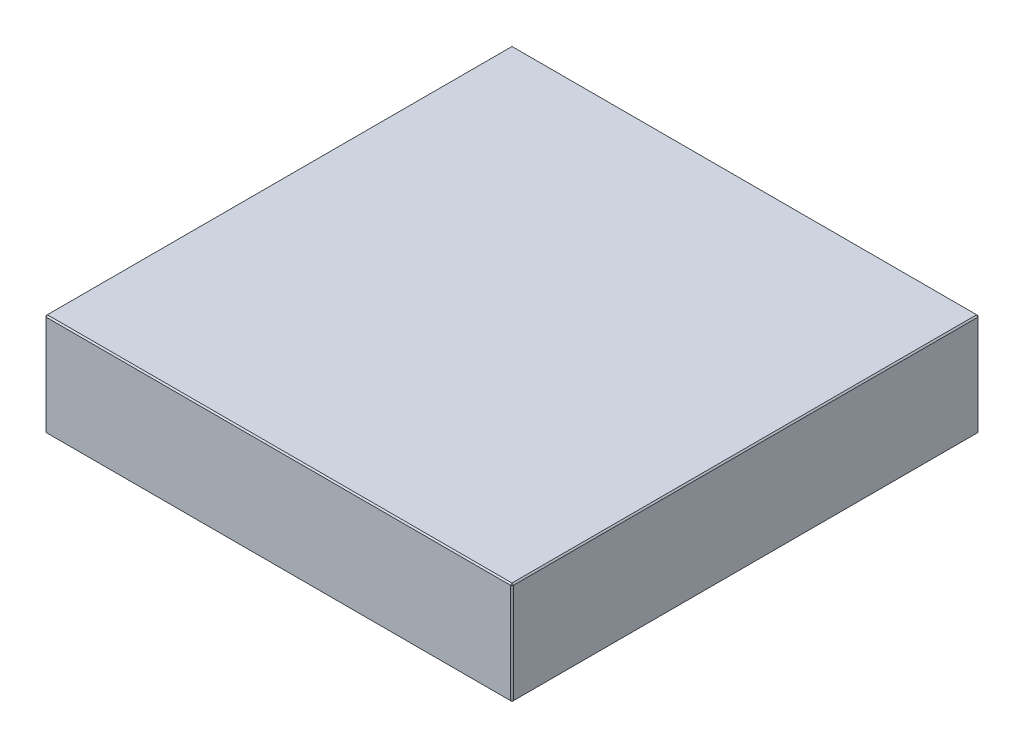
ISO-10303-21;
HEADER;
FILE_DESCRIPTION(('STEP AP214'),'2;1');
FILE_NAME('part.step','',(''),(''),'','','');
FILE_SCHEMA(('AUTOMOTIVE_DESIGN { 1 0 10303 214 1 1 1 1 }'));
ENDSEC;
DATA;
#1=APPLICATION_CONTEXT('core data for automotive mechanical design processes');
#2=APPLICATION_PROTOCOL_DEFINITION('international standard','automotive_design',2000,#1);
#3=PRODUCT_CONTEXT('',#1,'mechanical');
#4=PRODUCT('Part','Part','',(#3));
#5=PRODUCT_RELATED_PRODUCT_CATEGORY('part','',(#4));
#6=PRODUCT_DEFINITION_FORMATION('','',#4);
#7=PRODUCT_DEFINITION_CONTEXT('part definition',#1,'design');
#8=PRODUCT_DEFINITION('design','',#6,#7);
#9=PRODUCT_DEFINITION_SHAPE('','',#8);
#10=(LENGTH_UNIT() NAMED_UNIT(*) SI_UNIT(.MILLI.,.METRE.));
#11=(NAMED_UNIT(*) PLANE_ANGLE_UNIT() SI_UNIT($,.RADIAN.));
#12=(NAMED_UNIT(*) SI_UNIT($,.STERADIAN.) SOLID_ANGLE_UNIT());
#13=UNCERTAINTY_MEASURE_WITH_UNIT(LENGTH_MEASURE(1.E-05),#10,'distance_accuracy_value','');
#14=(GEOMETRIC_REPRESENTATION_CONTEXT(3) GLOBAL_UNCERTAINTY_ASSIGNED_CONTEXT((#13)) GLOBAL_UNIT_ASSIGNED_CONTEXT((#10,
#11,#12)) REPRESENTATION_CONTEXT('',''));
#15=CARTESIAN_POINT('',(0.,0.,0.));
#16=DIRECTION('',(0.,0.,1.));
#17=DIRECTION('',(1.,0.,0.));
#18=AXIS2_PLACEMENT_3D('',#15,#16,#17);
#19=CARTESIAN_POINT('',(-173.,76.,173.));
#20=DIRECTION('',(1.,0.,0.));
#21=DIRECTION('',(0.,0.,-1.));
#22=AXIS2_PLACEMENT_3D('',#19,#20,#21);
#23=PLANE('',#22);
#24=DIRECTION('',(0.,-1.,0.));
#25=VECTOR('',#24,1.);
#26=CARTESIAN_POINT('',(-173.,76.,-172.));
#27=LINE('',#26,#25);
#28=CARTESIAN_POINT('',(-173.,75.,-172.));
#29=VERTEX_POINT('',#28);
#30=CARTESIAN_POINT('',(-173.,1.,-172.));
#31=VERTEX_POINT('',#30);
#32=EDGE_CURVE('E114',#29,#31,#27,.T.);
#33=ORIENTED_EDGE('',*,*,#32,.T.);
#34=DIRECTION('',(0.,0.,1.));
#35=VECTOR('',#34,1.);
#36=CARTESIAN_POINT('',(-173.,1.,173.));
#37=LINE('',#36,#35);
#38=CARTESIAN_POINT('',(-173.,1.,172.));
#39=VERTEX_POINT('',#38);
#40=EDGE_CURVE('E110',#31,#39,#37,.T.);
#41=ORIENTED_EDGE('',*,*,#40,.T.);
#42=DIRECTION('',(0.,1.,0.));
#43=VECTOR('',#42,1.);
#44=CARTESIAN_POINT('',(-173.,76.,172.));
#45=LINE('',#44,#43);
#46=CARTESIAN_POINT('',(-173.,75.,172.));
#47=VERTEX_POINT('',#46);
#48=EDGE_CURVE('E103',#39,#47,#45,.T.);
#49=ORIENTED_EDGE('',*,*,#48,.T.);
#50=DIRECTION('',(0.,0.,-1.));
#51=VECTOR('',#50,1.);
#52=CARTESIAN_POINT('',(-173.,75.,-173.));
#53=LINE('',#52,#51);
#54=EDGE_CURVE('E107',#47,#29,#53,.T.);
#55=ORIENTED_EDGE('',*,*,#54,.T.);
#56=EDGE_LOOP('',(#33,#41,#49,#55));
#57=FACE_BOUND('',#56,.T.);
#58=ADVANCED_FACE('F15',(#57),#23,.F.);
#59=CARTESIAN_POINT('',(173.,76.,173.));
#60=DIRECTION('',(0.,0.,-1.));
#61=DIRECTION('',(-1.,0.,0.));
#62=AXIS2_PLACEMENT_3D('',#59,#60,#61);
#63=PLANE('',#62);
#64=DIRECTION('',(-1.,0.,0.));
#65=VECTOR('',#64,1.);
#66=CARTESIAN_POINT('',(-173.,75.,173.));
#67=LINE('',#66,#65);
#68=CARTESIAN_POINT('',(172.,75.,173.));
#69=VERTEX_POINT('',#68);
#70=CARTESIAN_POINT('',(-172.,75.,173.));
#71=VERTEX_POINT('',#70);
#72=EDGE_CURVE('E164',#69,#71,#67,.T.);
#73=ORIENTED_EDGE('',*,*,#72,.T.);
#74=DIRECTION('',(0.,-1.,0.));
#75=VECTOR('',#74,1.);
#76=CARTESIAN_POINT('',(-172.,76.,173.));
#77=LINE('',#76,#75);
#78=CARTESIAN_POINT('',(-172.,1.,173.));
#79=VERTEX_POINT('',#78);
#80=EDGE_CURVE('E122',#71,#79,#77,.T.);
#81=ORIENTED_EDGE('',*,*,#80,.T.);
#82=DIRECTION('',(1.,0.,0.));
#83=VECTOR('',#82,1.);
#84=CARTESIAN_POINT('',(173.,1.,173.));
#85=LINE('',#84,#83);
#86=CARTESIAN_POINT('',(172.,1.,173.));
#87=VERTEX_POINT('',#86);
#88=EDGE_CURVE('E168',#79,#87,#85,.T.);
#89=ORIENTED_EDGE('',*,*,#88,.T.);
#90=DIRECTION('',(0.,1.,0.));
#91=VECTOR('',#90,1.);
#92=CARTESIAN_POINT('',(172.,76.,173.));
#93=LINE('',#92,#91);
#94=EDGE_CURVE('E166',#87,#69,#93,.T.);
#95=ORIENTED_EDGE('',*,*,#94,.T.);
#96=EDGE_LOOP('',(#73,#81,#89,#95));
#97=FACE_BOUND('',#96,.T.);
#98=ADVANCED_FACE('F275',(#97),#63,.F.);
#99=CARTESIAN_POINT('',(173.,76.,173.));
#100=DIRECTION('',(-1.,0.,0.));
#101=DIRECTION('',(0.,0.,1.));
#102=AXIS2_PLACEMENT_3D('',#99,#100,#101);
#103=PLANE('',#102);
#104=DIRECTION('',(0.,0.,-1.));
#105=VECTOR('',#104,1.);
#106=CARTESIAN_POINT('',(173.,1.,173.));
#107=LINE('',#106,#105);
#108=CARTESIAN_POINT('',(173.,1.,172.));
#109=VERTEX_POINT('',#108);
#110=CARTESIAN_POINT('',(173.,1.,-172.));
#111=VERTEX_POINT('',#110);
#112=EDGE_CURVE('E159',#109,#111,#107,.T.);
#113=ORIENTED_EDGE('',*,*,#112,.T.);
#114=DIRECTION('',(0.,1.,0.));
#115=VECTOR('',#114,1.);
#116=CARTESIAN_POINT('',(173.,76.,-172.));
#117=LINE('',#116,#115);
#118=CARTESIAN_POINT('',(173.,75.,-172.));
#119=VERTEX_POINT('',#118);
#120=EDGE_CURVE('E161',#111,#119,#117,.T.);
#121=ORIENTED_EDGE('',*,*,#120,.T.);
#122=DIRECTION('',(0.,0.,1.));
#123=VECTOR('',#122,1.);
#124=CARTESIAN_POINT('',(173.,75.,173.));
#125=LINE('',#124,#123);
#126=CARTESIAN_POINT('',(173.,75.,172.));
#127=VERTEX_POINT('',#126);
#128=EDGE_CURVE('E155',#119,#127,#125,.T.);
#129=ORIENTED_EDGE('',*,*,#128,.T.);
#130=DIRECTION('',(0.,-1.,0.));
#131=VECTOR('',#130,1.);
#132=CARTESIAN_POINT('',(173.,76.,172.));
#133=LINE('',#132,#131);
#134=EDGE_CURVE('E157',#127,#109,#133,.T.);
#135=ORIENTED_EDGE('',*,*,#134,.T.);
#136=EDGE_LOOP('',(#113,#121,#129,#135));
#137=FACE_BOUND('',#136,.T.);
#138=ADVANCED_FACE('F254',(#137),#103,.F.);
#139=CARTESIAN_POINT('',(173.,76.,-173.));
#140=DIRECTION('',(0.,0.,1.));
#141=DIRECTION('',(1.,0.,0.));
#142=AXIS2_PLACEMENT_3D('',#139,#140,#141);
#143=PLANE('',#142);
#144=DIRECTION('',(0.,-1.,0.));
#145=VECTOR('',#144,1.);
#146=CARTESIAN_POINT('',(172.,76.,-173.));
#147=LINE('',#146,#145);
#148=CARTESIAN_POINT('',(172.,75.,-173.));
#149=VERTEX_POINT('',#148);
#150=CARTESIAN_POINT('',(172.,1.,-173.));
#151=VERTEX_POINT('',#150);
#152=EDGE_CURVE('E148',#149,#151,#147,.T.);
#153=ORIENTED_EDGE('',*,*,#152,.T.);
#154=DIRECTION('',(-1.,0.,0.));
#155=VECTOR('',#154,1.);
#156=CARTESIAN_POINT('',(173.,1.,-173.));
#157=LINE('',#156,#155);
#158=CARTESIAN_POINT('',(-172.,1.,-173.));
#159=VERTEX_POINT('',#158);
#160=EDGE_CURVE('E153',#151,#159,#157,.T.);
#161=ORIENTED_EDGE('',*,*,#160,.T.);
#162=DIRECTION('',(0.,1.,0.));
#163=VECTOR('',#162,1.);
#164=CARTESIAN_POINT('',(-172.,76.,-173.));
#165=LINE('',#164,#163);
#166=CARTESIAN_POINT('',(-172.,75.,-173.));
#167=VERTEX_POINT('',#166);
#168=EDGE_CURVE('E150',#159,#167,#165,.T.);
#169=ORIENTED_EDGE('',*,*,#168,.T.);
#170=DIRECTION('',(1.,0.,0.));
#171=VECTOR('',#170,1.);
#172=CARTESIAN_POINT('',(173.,75.,-173.));
#173=LINE('',#172,#171);
#174=EDGE_CURVE('E146',#167,#149,#173,.T.);
#175=ORIENTED_EDGE('',*,*,#174,.T.);
#176=EDGE_LOOP('',(#153,#161,#169,#175));
#177=FACE_BOUND('',#176,.T.);
#178=ADVANCED_FACE('F284',(#177),#143,.F.);
#179=CARTESIAN_POINT('',(0.,76.,0.));
#180=DIRECTION('',(0.,1.,0.));
#181=DIRECTION('',(0.,0.,1.));
#182=AXIS2_PLACEMENT_3D('',#179,#180,#181);
#183=PLANE('',#182);
#184=DIRECTION('',(0.,0.,-1.));
#185=VECTOR('',#184,1.);
#186=CARTESIAN_POINT('',(172.,76.,-173.));
#187=LINE('',#186,#185);
#188=CARTESIAN_POINT('',(172.,76.,172.));
#189=VERTEX_POINT('',#188);
#190=CARTESIAN_POINT('',(172.,76.,-172.));
#191=VERTEX_POINT('',#190);
#192=EDGE_CURVE('E24',#189,#191,#187,.T.);
#193=ORIENTED_EDGE('',*,*,#192,.T.);
#194=DIRECTION('',(-1.,0.,0.));
#195=VECTOR('',#194,1.);
#196=CARTESIAN_POINT('',(-173.,76.,-172.));
#197=LINE('',#196,#195);
#198=CARTESIAN_POINT('',(-172.,76.,-172.));
#199=VERTEX_POINT('',#198);
#200=EDGE_CURVE('E9',#191,#199,#197,.T.);
#201=ORIENTED_EDGE('',*,*,#200,.T.);
#202=DIRECTION('',(0.,0.,1.));
#203=VECTOR('',#202,1.);
#204=CARTESIAN_POINT('',(-172.,76.,173.));
#205=LINE('',#204,#203);
#206=CARTESIAN_POINT('',(-172.,76.,172.));
#207=VERTEX_POINT('',#206);
#208=EDGE_CURVE('E180',#199,#207,#205,.T.);
#209=ORIENTED_EDGE('',*,*,#208,.T.);
#210=DIRECTION('',(1.,0.,0.));
#211=VECTOR('',#210,1.);
#212=CARTESIAN_POINT('',(173.,76.,172.));
#213=LINE('',#212,#211);
#214=EDGE_CURVE('E35',#207,#189,#213,.T.);
#215=ORIENTED_EDGE('',*,*,#214,.T.);
#216=EDGE_LOOP('',(#193,#201,#209,#215));
#217=FACE_BOUND('',#216,.T.);
#218=ADVANCED_FACE('F350',(#217),#183,.T.);
#219=CARTESIAN_POINT('',(0.,0.,0.));
#220=DIRECTION('',(0.,1.,0.));
#221=DIRECTION('',(0.,0.,1.));
#222=AXIS2_PLACEMENT_3D('',#219,#220,#221);
#223=PLANE('',#222);
#224=DIRECTION('',(0.,0.,1.));
#225=VECTOR('',#224,1.);
#226=CARTESIAN_POINT('',(172.,0.,0.));
#227=LINE('',#226,#225);
#228=CARTESIAN_POINT('',(172.,0.,-172.));
#229=VERTEX_POINT('',#228);
#230=CARTESIAN_POINT('',(172.,0.,172.));
#231=VERTEX_POINT('',#230);
#232=EDGE_CURVE('E171',#229,#231,#227,.T.);
#233=ORIENTED_EDGE('',*,*,#232,.T.);
#234=DIRECTION('',(-1.,0.,0.));
#235=VECTOR('',#234,1.);
#236=CARTESIAN_POINT('',(0.,0.,172.));
#237=LINE('',#236,#235);
#238=CARTESIAN_POINT('',(-172.,0.,172.));
#239=VERTEX_POINT('',#238);
#240=EDGE_CURVE('E177',#231,#239,#237,.T.);
#241=ORIENTED_EDGE('',*,*,#240,.T.);
#242=DIRECTION('',(0.,0.,-1.));
#243=VECTOR('',#242,1.);
#244=CARTESIAN_POINT('',(-172.,0.,0.));
#245=LINE('',#244,#243);
#246=CARTESIAN_POINT('',(-172.,0.,-172.));
#247=VERTEX_POINT('',#246);
#248=EDGE_CURVE('E175',#239,#247,#245,.T.);
#249=ORIENTED_EDGE('',*,*,#248,.T.);
#250=DIRECTION('',(1.,0.,0.));
#251=VECTOR('',#250,1.);
#252=CARTESIAN_POINT('',(0.,0.,-172.));
#253=LINE('',#252,#251);
#254=EDGE_CURVE('E173',#247,#229,#253,.T.);
#255=ORIENTED_EDGE('',*,*,#254,.T.);
#256=EDGE_LOOP('',(#233,#241,#249,#255));
#257=FACE_BOUND('',#256,.T.);
#258=ADVANCED_FACE('F246',(#257),#223,.F.);
#259=CARTESIAN_POINT('',(173.,76.,172.));
#260=DIRECTION('',(-0.707106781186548,0.,-0.707106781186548));
#261=DIRECTION('',(0.,-1.,0.));
#262=AXIS2_PLACEMENT_3D('',#259,#260,#261);
#263=PLANE('',#262);
#264=DIRECTION('',(-0.707106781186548,0.,0.707106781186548));
#265=VECTOR('',#264,1.);
#266=CARTESIAN_POINT('',(172.,75.,173.));
#267=LINE('',#266,#265);
#268=EDGE_CURVE('E19',#69,#127,#267,.F.);
#269=ORIENTED_EDGE('',*,*,#268,.F.);
#270=ORIENTED_EDGE('',*,*,#94,.F.);
#271=DIRECTION('',(0.707106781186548,0.,-0.707106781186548));
#272=VECTOR('',#271,1.);
#273=CARTESIAN_POINT('',(172.,1.,173.));
#274=LINE('',#273,#272);
#275=EDGE_CURVE('E142',#109,#87,#274,.F.);
#276=ORIENTED_EDGE('',*,*,#275,.F.);
#277=ORIENTED_EDGE('',*,*,#134,.F.);
#278=EDGE_LOOP('',(#269,#270,#276,#277));
#279=FACE_BOUND('',#278,.T.);
#280=ADVANCED_FACE('F17',(#279),#263,.F.);
#281=CARTESIAN_POINT('',(172.,75.,173.));
#282=DIRECTION('',(0.577350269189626,0.577350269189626,0.577350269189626));
#283=DIRECTION('',(0.707106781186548,0.,-0.707106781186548));
#284=AXIS2_PLACEMENT_3D('',#281,#282,#283);
#285=PLANE('',#284);
#286=DIRECTION('',(0.,-0.707106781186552,0.707106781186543));
#287=VECTOR('',#286,1.);
#288=CARTESIAN_POINT('',(172.,75.,173.));
#289=LINE('',#288,#287);
#290=EDGE_CURVE('E226',#69,#189,#289,.F.);
#291=ORIENTED_EDGE('',*,*,#290,.F.);
#292=ORIENTED_EDGE('',*,*,#268,.T.);
#293=DIRECTION('',(-0.707106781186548,0.707106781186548,0.));
#294=VECTOR('',#293,1.);
#295=CARTESIAN_POINT('',(172.5,75.5,172.));
#296=LINE('',#295,#294);
#297=EDGE_CURVE('E228',#189,#127,#296,.F.);
#298=ORIENTED_EDGE('',*,*,#297,.F.);
#299=EDGE_LOOP('',(#291,#292,#298));
#300=FACE_BOUND('',#299,.T.);
#301=ADVANCED_FACE('F270',(#300),#285,.T.);
#302=CARTESIAN_POINT('',(172.,1.,173.));
#303=DIRECTION('',(0.577350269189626,-0.577350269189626,0.577350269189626));
#304=DIRECTION('',(0.707106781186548,0.,-0.707106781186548));
#305=AXIS2_PLACEMENT_3D('',#302,#303,#304);
#306=PLANE('',#305);
#307=DIRECTION('',(-0.707106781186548,-0.707106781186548,0.));
#308=VECTOR('',#307,1.);
#309=CARTESIAN_POINT('',(172.5,0.5,172.));
#310=LINE('',#309,#308);
#311=EDGE_CURVE('E220',#109,#231,#310,.T.);
#312=ORIENTED_EDGE('',*,*,#311,.F.);
#313=ORIENTED_EDGE('',*,*,#275,.T.);
#314=DIRECTION('',(0.,0.707106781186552,0.707106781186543));
#315=VECTOR('',#314,1.);
#316=CARTESIAN_POINT('',(172.,1.,173.));
#317=LINE('',#316,#315);
#318=EDGE_CURVE('E223',#231,#87,#317,.T.);
#319=ORIENTED_EDGE('',*,*,#318,.F.);
#320=EDGE_LOOP('',(#312,#313,#319));
#321=FACE_BOUND('',#320,.T.);
#322=ADVANCED_FACE('F235',(#321),#306,.T.);
#323=CARTESIAN_POINT('',(172.,76.,0.));
#324=DIRECTION('',(0.707106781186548,0.707106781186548,0.));
#325=DIRECTION('',(0.,0.,1.));
#326=AXIS2_PLACEMENT_3D('',#323,#324,#325);
#327=PLANE('',#326);
#328=ORIENTED_EDGE('',*,*,#297,.T.);
#329=ORIENTED_EDGE('',*,*,#128,.F.);
#330=DIRECTION('',(0.707106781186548,-0.707106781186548,0.));
#331=VECTOR('',#330,1.);
#332=CARTESIAN_POINT('',(173.,75.,-172.));
#333=LINE('',#332,#331);
#334=EDGE_CURVE('E215',#191,#119,#333,.T.);
#335=ORIENTED_EDGE('',*,*,#334,.F.);
#336=ORIENTED_EDGE('',*,*,#192,.F.);
#337=EDGE_LOOP('',(#328,#329,#335,#336));
#338=FACE_BOUND('',#337,.T.);
#339=ADVANCED_FACE('F265',(#338),#327,.T.);
#340=CARTESIAN_POINT('',(0.,76.,172.));
#341=DIRECTION('',(0.,0.707106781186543,0.707106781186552));
#342=DIRECTION('',(-1.,0.,0.));
#343=AXIS2_PLACEMENT_3D('',#340,#341,#342);
#344=PLANE('',#343);
#345=ORIENTED_EDGE('',*,*,#290,.T.);
#346=ORIENTED_EDGE('',*,*,#214,.F.);
#347=DIRECTION('',(0.,0.707106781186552,-0.707106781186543));
#348=VECTOR('',#347,1.);
#349=CARTESIAN_POINT('',(-172.,75.5,172.5));
#350=LINE('',#349,#348);
#351=EDGE_CURVE('E126',#71,#207,#350,.T.);
#352=ORIENTED_EDGE('',*,*,#351,.F.);
#353=ORIENTED_EDGE('',*,*,#72,.F.);
#354=EDGE_LOOP('',(#345,#346,#352,#353));
#355=FACE_BOUND('',#354,.T.);
#356=ADVANCED_FACE('F273',(#355),#344,.T.);
#357=CARTESIAN_POINT('',(-172.,76.,173.));
#358=DIRECTION('',(0.707106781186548,0.,-0.707106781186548));
#359=DIRECTION('',(0.,-1.,0.));
#360=AXIS2_PLACEMENT_3D('',#357,#358,#359);
#361=PLANE('',#360);
#362=DIRECTION('',(0.707106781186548,0.,0.707106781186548));
#363=VECTOR('',#362,1.);
#364=CARTESIAN_POINT('',(-172.,1.,173.));
#365=LINE('',#364,#363);
#366=EDGE_CURVE('E127',#79,#39,#365,.F.);
#367=ORIENTED_EDGE('',*,*,#366,.F.);
#368=ORIENTED_EDGE('',*,*,#80,.F.);
#369=DIRECTION('',(-0.707106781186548,0.,-0.707106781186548));
#370=VECTOR('',#369,1.);
#371=CARTESIAN_POINT('',(-173.,75.,172.));
#372=LINE('',#371,#370);
#373=EDGE_CURVE('E118',#47,#71,#372,.F.);
#374=ORIENTED_EDGE('',*,*,#373,.F.);
#375=ORIENTED_EDGE('',*,*,#48,.F.);
#376=EDGE_LOOP('',(#367,#368,#374,#375));
#377=FACE_BOUND('',#376,.T.);
#378=ADVANCED_FACE('F120',(#377),#361,.F.);
#379=CARTESIAN_POINT('',(173.,1.,173.));
#380=DIRECTION('',(0.,0.707106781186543,-0.707106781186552));
#381=DIRECTION('',(1.,0.,0.));
#382=AXIS2_PLACEMENT_3D('',#379,#380,#381);
#383=PLANE('',#382);
#384=ORIENTED_EDGE('',*,*,#318,.T.);
#385=ORIENTED_EDGE('',*,*,#88,.F.);
#386=DIRECTION('',(0.,-0.707106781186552,-0.707106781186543));
#387=VECTOR('',#386,1.);
#388=CARTESIAN_POINT('',(-172.,1.,173.));
#389=LINE('',#388,#387);
#390=EDGE_CURVE('E211',#239,#79,#389,.F.);
#391=ORIENTED_EDGE('',*,*,#390,.F.);
#392=ORIENTED_EDGE('',*,*,#240,.F.);
#393=EDGE_LOOP('',(#384,#385,#391,#392));
#394=FACE_BOUND('',#393,.T.);
#395=ADVANCED_FACE('F243',(#394),#383,.F.);
#396=CARTESIAN_POINT('',(173.,1.,173.));
#397=DIRECTION('',(-0.707106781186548,0.707106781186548,0.));
#398=DIRECTION('',(0.,0.,-1.));
#399=AXIS2_PLACEMENT_3D('',#396,#397,#398);
#400=PLANE('',#399);
#401=ORIENTED_EDGE('',*,*,#311,.T.);
#402=ORIENTED_EDGE('',*,*,#232,.F.);
#403=DIRECTION('',(0.707106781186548,0.707106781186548,0.));
#404=VECTOR('',#403,1.);
#405=CARTESIAN_POINT('',(172.5,0.499999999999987,-172.));
#406=LINE('',#405,#404);
#407=EDGE_CURVE('E208',#111,#229,#406,.F.);
#408=ORIENTED_EDGE('',*,*,#407,.F.);
#409=ORIENTED_EDGE('',*,*,#112,.F.);
#410=EDGE_LOOP('',(#401,#402,#408,#409));
#411=FACE_BOUND('',#410,.T.);
#412=ADVANCED_FACE('F251',(#411),#400,.F.);
#413=CARTESIAN_POINT('',(172.,76.,-173.));
#414=DIRECTION('',(-0.707106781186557,0.,0.707106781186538));
#415=DIRECTION('',(0.,-1.,0.));
#416=AXIS2_PLACEMENT_3D('',#413,#414,#415);
#417=PLANE('',#416);
#418=DIRECTION('',(0.707106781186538,0.,0.707106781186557));
#419=VECTOR('',#418,1.);
#420=CARTESIAN_POINT('',(173.,75.,-172.));
#421=LINE('',#420,#419);
#422=EDGE_CURVE('E217',#119,#149,#421,.F.);
#423=ORIENTED_EDGE('',*,*,#422,.F.);
#424=ORIENTED_EDGE('',*,*,#120,.F.);
#425=DIRECTION('',(-0.707106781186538,0.,-0.707106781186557));
#426=VECTOR('',#425,1.);
#427=CARTESIAN_POINT('',(172.,1.,-173.));
#428=LINE('',#427,#426);
#429=EDGE_CURVE('E205',#151,#111,#428,.F.);
#430=ORIENTED_EDGE('',*,*,#429,.F.);
#431=ORIENTED_EDGE('',*,*,#152,.F.);
#432=EDGE_LOOP('',(#423,#424,#430,#431));
#433=FACE_BOUND('',#432,.T.);
#434=ADVANCED_FACE('F258',(#433),#417,.F.);
#435=CARTESIAN_POINT('',(173.,75.,-172.));
#436=DIRECTION('',(0.577350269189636,0.57735026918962,-0.57735026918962));
#437=DIRECTION('',(-0.707106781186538,0.,-0.707106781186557));
#438=AXIS2_PLACEMENT_3D('',#435,#436,#437);
#439=PLANE('',#438);
#440=ORIENTED_EDGE('',*,*,#334,.T.);
#441=ORIENTED_EDGE('',*,*,#422,.T.);
#442=DIRECTION('',(0.,0.707106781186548,0.707106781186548));
#443=VECTOR('',#442,1.);
#444=CARTESIAN_POINT('',(172.,75.5,-172.5));
#445=LINE('',#444,#443);
#446=EDGE_CURVE('E134',#191,#149,#445,.F.);
#447=ORIENTED_EDGE('',*,*,#446,.F.);
#448=EDGE_LOOP('',(#440,#441,#447));
#449=FACE_BOUND('',#448,.T.);
#450=ADVANCED_FACE('F325',(#449),#439,.T.);
#451=CARTESIAN_POINT('',(-173.,75.,172.));
#452=DIRECTION('',(-0.577350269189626,0.577350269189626,0.577350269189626));
#453=DIRECTION('',(0.707106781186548,0.,0.707106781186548));
#454=AXIS2_PLACEMENT_3D('',#451,#452,#453);
#455=PLANE('',#454);
#456=ORIENTED_EDGE('',*,*,#373,.T.);
#457=ORIENTED_EDGE('',*,*,#351,.T.);
#458=DIRECTION('',(-0.707106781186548,-0.707106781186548,0.));
#459=VECTOR('',#458,1.);
#460=CARTESIAN_POINT('',(-173.,75.,172.));
#461=LINE('',#460,#459);
#462=EDGE_CURVE('E130',#47,#207,#461,.F.);
#463=ORIENTED_EDGE('',*,*,#462,.F.);
#464=EDGE_LOOP('',(#456,#457,#463));
#465=FACE_BOUND('',#464,.T.);
#466=ADVANCED_FACE('F131',(#465),#455,.T.);
#467=CARTESIAN_POINT('',(-172.,1.,173.));
#468=DIRECTION('',(-0.577350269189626,-0.577350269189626,0.577350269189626));
#469=DIRECTION('',(0.707106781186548,0.,0.707106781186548));
#470=AXIS2_PLACEMENT_3D('',#467,#468,#469);
#471=PLANE('',#470);
#472=ORIENTED_EDGE('',*,*,#390,.T.);
#473=ORIENTED_EDGE('',*,*,#366,.T.);
#474=DIRECTION('',(-0.707106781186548,0.707106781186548,0.));
#475=VECTOR('',#474,1.);
#476=CARTESIAN_POINT('',(-172.5,0.5,172.));
#477=LINE('',#476,#475);
#478=EDGE_CURVE('E135',#239,#39,#477,.T.);
#479=ORIENTED_EDGE('',*,*,#478,.F.);
#480=EDGE_LOOP('',(#472,#473,#479));
#481=FACE_BOUND('',#480,.T.);
#482=ADVANCED_FACE('F318',(#481),#471,.T.);
#483=CARTESIAN_POINT('',(172.,1.,-173.));
#484=DIRECTION('',(0.577350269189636,-0.57735026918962,-0.57735026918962));
#485=DIRECTION('',(-0.707106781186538,0.,-0.707106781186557));
#486=AXIS2_PLACEMENT_3D('',#483,#484,#485);
#487=PLANE('',#486);
#488=ORIENTED_EDGE('',*,*,#429,.T.);
#489=ORIENTED_EDGE('',*,*,#407,.T.);
#490=DIRECTION('',(0.,-0.707106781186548,0.707106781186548));
#491=VECTOR('',#490,1.);
#492=CARTESIAN_POINT('',(172.,1.,-173.));
#493=LINE('',#492,#491);
#494=EDGE_CURVE('E198',#151,#229,#493,.T.);
#495=ORIENTED_EDGE('',*,*,#494,.F.);
#496=EDGE_LOOP('',(#488,#489,#495));
#497=FACE_BOUND('',#496,.T.);
#498=ADVANCED_FACE('F314',(#497),#487,.T.);
#499=CARTESIAN_POINT('',(0.,76.,-172.));
#500=DIRECTION('',(0.,0.707106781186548,-0.707106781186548));
#501=DIRECTION('',(1.,0.,0.));
#502=AXIS2_PLACEMENT_3D('',#499,#500,#501);
#503=PLANE('',#502);
#504=ORIENTED_EDGE('',*,*,#446,.T.);
#505=ORIENTED_EDGE('',*,*,#174,.F.);
#506=DIRECTION('',(0.,-0.707106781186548,-0.707106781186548));
#507=VECTOR('',#506,1.);
#508=CARTESIAN_POINT('',(-172.,75.,-173.));
#509=LINE('',#508,#507);
#510=EDGE_CURVE('E195',#199,#167,#509,.T.);
#511=ORIENTED_EDGE('',*,*,#510,.F.);
#512=ORIENTED_EDGE('',*,*,#200,.F.);
#513=EDGE_LOOP('',(#504,#505,#511,#512));
#514=FACE_BOUND('',#513,.T.);
#515=ADVANCED_FACE('F311',(#514),#503,.T.);
#516=CARTESIAN_POINT('',(-172.,76.,0.));
#517=DIRECTION('',(-0.707106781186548,0.707106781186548,0.));
#518=DIRECTION('',(0.,0.,-1.));
#519=AXIS2_PLACEMENT_3D('',#516,#517,#518);
#520=PLANE('',#519);
#521=ORIENTED_EDGE('',*,*,#462,.T.);
#522=ORIENTED_EDGE('',*,*,#208,.F.);
#523=DIRECTION('',(0.707106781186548,0.707106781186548,0.));
#524=VECTOR('',#523,1.);
#525=CARTESIAN_POINT('',(-172.5,75.5,-172.));
#526=LINE('',#525,#524);
#527=EDGE_CURVE('E138',#29,#199,#526,.T.);
#528=ORIENTED_EDGE('',*,*,#527,.F.);
#529=ORIENTED_EDGE('',*,*,#54,.F.);
#530=EDGE_LOOP('',(#521,#522,#528,#529));
#531=FACE_BOUND('',#530,.T.);
#532=ADVANCED_FACE('F137',(#531),#520,.T.);
#533=CARTESIAN_POINT('',(-173.,1.,173.));
#534=DIRECTION('',(0.707106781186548,0.707106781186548,0.));
#535=DIRECTION('',(0.,0.,1.));
#536=AXIS2_PLACEMENT_3D('',#533,#534,#535);
#537=PLANE('',#536);
#538=ORIENTED_EDGE('',*,*,#478,.T.);
#539=ORIENTED_EDGE('',*,*,#40,.F.);
#540=DIRECTION('',(0.707106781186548,-0.707106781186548,0.));
#541=VECTOR('',#540,1.);
#542=CARTESIAN_POINT('',(-173.,1.,-172.));
#543=LINE('',#542,#541);
#544=EDGE_CURVE('E191',#247,#31,#543,.F.);
#545=ORIENTED_EDGE('',*,*,#544,.F.);
#546=ORIENTED_EDGE('',*,*,#248,.F.);
#547=EDGE_LOOP('',(#538,#539,#545,#546));
#548=FACE_BOUND('',#547,.T.);
#549=ADVANCED_FACE('F304',(#548),#537,.F.);
#550=CARTESIAN_POINT('',(173.,1.,-173.));
#551=DIRECTION('',(0.,0.707106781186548,0.707106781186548));
#552=DIRECTION('',(-1.,0.,0.));
#553=AXIS2_PLACEMENT_3D('',#550,#551,#552);
#554=PLANE('',#553);
#555=ORIENTED_EDGE('',*,*,#494,.T.);
#556=ORIENTED_EDGE('',*,*,#254,.F.);
#557=DIRECTION('',(0.,0.707106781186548,-0.707106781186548));
#558=VECTOR('',#557,1.);
#559=CARTESIAN_POINT('',(-172.,0.5,-172.5));
#560=LINE('',#559,#558);
#561=EDGE_CURVE('E188',#159,#247,#560,.F.);
#562=ORIENTED_EDGE('',*,*,#561,.F.);
#563=ORIENTED_EDGE('',*,*,#160,.F.);
#564=EDGE_LOOP('',(#555,#556,#562,#563));
#565=FACE_BOUND('',#564,.T.);
#566=ADVANCED_FACE('F300',(#565),#554,.F.);
#567=CARTESIAN_POINT('',(-172.,75.,-173.));
#568=DIRECTION('',(-0.577350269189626,0.577350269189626,-0.577350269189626));
#569=DIRECTION('',(-0.707106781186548,0.,0.707106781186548));
#570=AXIS2_PLACEMENT_3D('',#567,#568,#569);
#571=PLANE('',#570);
#572=ORIENTED_EDGE('',*,*,#527,.T.);
#573=ORIENTED_EDGE('',*,*,#510,.T.);
#574=DIRECTION('',(0.707106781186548,0.,-0.707106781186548));
#575=VECTOR('',#574,1.);
#576=CARTESIAN_POINT('',(-172.,75.,-173.));
#577=LINE('',#576,#575);
#578=EDGE_CURVE('E186',#29,#167,#577,.T.);
#579=ORIENTED_EDGE('',*,*,#578,.F.);
#580=EDGE_LOOP('',(#572,#573,#579));
#581=FACE_BOUND('',#580,.T.);
#582=ADVANCED_FACE('F296',(#581),#571,.T.);
#583=CARTESIAN_POINT('',(-173.,1.,-172.));
#584=DIRECTION('',(-0.577350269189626,-0.577350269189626,-0.577350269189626));
#585=DIRECTION('',(-0.707106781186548,0.,0.707106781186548));
#586=AXIS2_PLACEMENT_3D('',#583,#584,#585);
#587=PLANE('',#586);
#588=ORIENTED_EDGE('',*,*,#561,.T.);
#589=ORIENTED_EDGE('',*,*,#544,.T.);
#590=DIRECTION('',(-0.707106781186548,0.,0.707106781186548));
#591=VECTOR('',#590,1.);
#592=CARTESIAN_POINT('',(-173.,1.,-172.));
#593=LINE('',#592,#591);
#594=EDGE_CURVE('E184',#159,#31,#593,.T.);
#595=ORIENTED_EDGE('',*,*,#594,.F.);
#596=EDGE_LOOP('',(#588,#589,#595));
#597=FACE_BOUND('',#596,.T.);
#598=ADVANCED_FACE('F292',(#597),#587,.T.);
#599=CARTESIAN_POINT('',(-173.,76.,-172.));
#600=DIRECTION('',(0.707106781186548,0.,0.707106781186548));
#601=DIRECTION('',(0.,-1.,0.));
#602=AXIS2_PLACEMENT_3D('',#599,#600,#601);
#603=PLANE('',#602);
#604=ORIENTED_EDGE('',*,*,#578,.T.);
#605=ORIENTED_EDGE('',*,*,#168,.F.);
#606=ORIENTED_EDGE('',*,*,#594,.T.);
#607=ORIENTED_EDGE('',*,*,#32,.F.);
#608=EDGE_LOOP('',(#604,#605,#606,#607));
#609=FACE_BOUND('',#608,.T.);
#610=ADVANCED_FACE('F289',(#609),#603,.F.);
#611=CLOSED_SHELL('',(#58,#98,#138,#178,#218,#258,#280,#301,#322,#339,#356,#378,#395,#412,#434,
#450,#466,#482,#498,#515,#532,#549,#566,#582,#598,#610));
#612=MANIFOLD_SOLID_BREP('B1',#611);
#613=ADVANCED_BREP_SHAPE_REPRESENTATION('',(#18,#612),#14);
#614=SHAPE_DEFINITION_REPRESENTATION(#9,#613);
ENDSEC;
END-ISO-10303-21;
